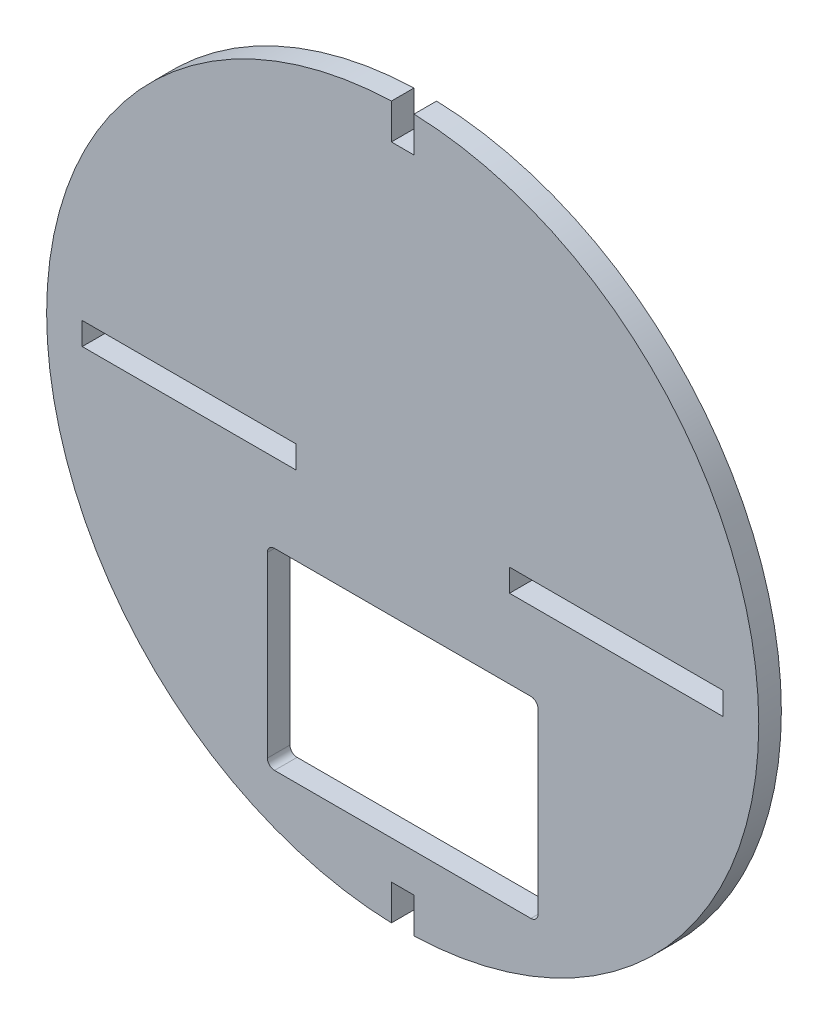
ISO-10303-21;
HEADER;
FILE_DESCRIPTION(('STEP AP214'),'2;1');
FILE_NAME('part.step','',(''),(''),'','','');
FILE_SCHEMA(('AUTOMOTIVE_DESIGN { 1 0 10303 214 1 1 1 1 }'));
ENDSEC;
DATA;
#1=APPLICATION_CONTEXT('core data for automotive mechanical design processes');
#2=APPLICATION_PROTOCOL_DEFINITION('international standard','automotive_design',2000,#1);
#3=PRODUCT_CONTEXT('',#1,'mechanical');
#4=PRODUCT('Part','Part','',(#3));
#5=PRODUCT_RELATED_PRODUCT_CATEGORY('part','',(#4));
#6=PRODUCT_DEFINITION_FORMATION('','',#4);
#7=PRODUCT_DEFINITION_CONTEXT('part definition',#1,'design');
#8=PRODUCT_DEFINITION('design','',#6,#7);
#9=PRODUCT_DEFINITION_SHAPE('','',#8);
#10=(LENGTH_UNIT() NAMED_UNIT(*) SI_UNIT(.MILLI.,.METRE.));
#11=(NAMED_UNIT(*) PLANE_ANGLE_UNIT() SI_UNIT($,.RADIAN.));
#12=(NAMED_UNIT(*) SI_UNIT($,.STERADIAN.) SOLID_ANGLE_UNIT());
#13=UNCERTAINTY_MEASURE_WITH_UNIT(LENGTH_MEASURE(1.E-05),#10,'distance_accuracy_value','');
#14=(GEOMETRIC_REPRESENTATION_CONTEXT(3) GLOBAL_UNCERTAINTY_ASSIGNED_CONTEXT((#13)) GLOBAL_UNIT_ASSIGNED_CONTEXT((#10,
#11,#12)) REPRESENTATION_CONTEXT('',''));
#15=CARTESIAN_POINT('',(0.,0.,0.));
#16=DIRECTION('',(0.,0.,1.));
#17=DIRECTION('',(1.,0.,0.));
#18=AXIS2_PLACEMENT_3D('',#15,#16,#17);
#19=CARTESIAN_POINT('',(0.,0.,3.175));
#20=DIRECTION('',(0.,0.,1.));
#21=DIRECTION('',(1.,0.,0.));
#22=AXIS2_PLACEMENT_3D('',#19,#20,#21);
#23=PLANE('',#22);
#24=CARTESIAN_POINT('',(0.,0.,3.175));
#25=DIRECTION('',(0.,0.,1.));
#26=DIRECTION('',(1.,0.,0.));
#27=AXIS2_PLACEMENT_3D('',#24,#25,#26);
#28=CIRCLE('',#27,50.);
#29=CARTESIAN_POINT('',(1.5875,-49.9747920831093,3.175));
#30=VERTEX_POINT('',#29);
#31=CARTESIAN_POINT('',(1.5875,49.9747920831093,3.175));
#32=VERTEX_POINT('',#31);
#33=EDGE_CURVE('E323',#30,#32,#28,.T.);
#34=ORIENTED_EDGE('',*,*,#33,.T.);
#35=DIRECTION('',(0.,-1.,0.));
#36=VECTOR('',#35,1.);
#37=CARTESIAN_POINT('',(1.5875,49.9747920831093,3.175));
#38=LINE('',#37,#36);
#39=CARTESIAN_POINT('',(1.5875,45.,3.175));
#40=VERTEX_POINT('',#39);
#41=EDGE_CURVE('E326',#32,#40,#38,.T.);
#42=ORIENTED_EDGE('',*,*,#41,.T.);
#43=DIRECTION('',(-1.,0.,0.));
#44=VECTOR('',#43,1.);
#45=CARTESIAN_POINT('',(-1.5875,45.,3.175));
#46=LINE('',#45,#44);
#47=CARTESIAN_POINT('',(-1.5875,45.,3.175));
#48=VERTEX_POINT('',#47);
#49=EDGE_CURVE('E329',#40,#48,#46,.T.);
#50=ORIENTED_EDGE('',*,*,#49,.T.);
#51=DIRECTION('',(0.,1.,0.));
#52=VECTOR('',#51,1.);
#53=CARTESIAN_POINT('',(-1.5875,49.9747920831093,3.175));
#54=LINE('',#53,#52);
#55=CARTESIAN_POINT('',(-1.5875,49.9747920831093,3.175));
#56=VERTEX_POINT('',#55);
#57=EDGE_CURVE('E331',#48,#56,#54,.T.);
#58=ORIENTED_EDGE('',*,*,#57,.T.);
#59=CARTESIAN_POINT('',(0.,0.,3.175));
#60=DIRECTION('',(0.,0.,1.));
#61=DIRECTION('',(1.,0.,0.));
#62=AXIS2_PLACEMENT_3D('',#59,#60,#61);
#63=CIRCLE('',#62,50.);
#64=CARTESIAN_POINT('',(-1.5875,-49.9747920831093,3.175));
#65=VERTEX_POINT('',#64);
#66=EDGE_CURVE('E333',#56,#65,#63,.T.);
#67=ORIENTED_EDGE('',*,*,#66,.T.);
#68=DIRECTION('',(0.,1.,0.));
#69=VECTOR('',#68,1.);
#70=CARTESIAN_POINT('',(-1.5875,-49.9747920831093,3.175));
#71=LINE('',#70,#69);
#72=CARTESIAN_POINT('',(-1.5875,-45.,3.175));
#73=VERTEX_POINT('',#72);
#74=EDGE_CURVE('E335',#65,#73,#71,.T.);
#75=ORIENTED_EDGE('',*,*,#74,.T.);
#76=DIRECTION('',(1.,0.,0.));
#77=VECTOR('',#76,1.);
#78=CARTESIAN_POINT('',(-1.5875,-45.,3.175));
#79=LINE('',#78,#77);
#80=CARTESIAN_POINT('',(1.5875,-45.,3.175));
#81=VERTEX_POINT('',#80);
#82=EDGE_CURVE('E337',#73,#81,#79,.T.);
#83=ORIENTED_EDGE('',*,*,#82,.T.);
#84=DIRECTION('',(0.,-1.,0.));
#85=VECTOR('',#84,1.);
#86=CARTESIAN_POINT('',(1.5875,-49.9747920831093,3.175));
#87=LINE('',#86,#85);
#88=EDGE_CURVE('E339',#81,#30,#87,.T.);
#89=ORIENTED_EDGE('',*,*,#88,.T.);
#90=EDGE_LOOP('',(#34,#42,#50,#58,#67,#75,#83,#89));
#91=FACE_BOUND('',#90,.T.);
#92=DIRECTION('',(-1.,0.,0.));
#93=VECTOR('',#92,1.);
#94=CARTESIAN_POINT('',(-45.,1.58749999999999,3.175));
#95=LINE('',#94,#93);
#96=CARTESIAN_POINT('',(-15.,1.58749999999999,3.175));
#97=VERTEX_POINT('',#96);
#98=CARTESIAN_POINT('',(-45.,1.58749999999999,3.175));
#99=VERTEX_POINT('',#98);
#100=EDGE_CURVE('E294',#97,#99,#95,.T.);
#101=ORIENTED_EDGE('',*,*,#100,.F.);
#102=DIRECTION('',(0.,1.,0.));
#103=VECTOR('',#102,1.);
#104=CARTESIAN_POINT('',(-15.,-1.58750000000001,3.175));
#105=LINE('',#104,#103);
#106=CARTESIAN_POINT('',(-15.,-1.58750000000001,3.175));
#107=VERTEX_POINT('',#106);
#108=EDGE_CURVE('E292',#107,#97,#105,.T.);
#109=ORIENTED_EDGE('',*,*,#108,.F.);
#110=DIRECTION('',(1.,0.,0.));
#111=VECTOR('',#110,1.);
#112=CARTESIAN_POINT('',(-45.,-1.58750000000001,3.175));
#113=LINE('',#112,#111);
#114=CARTESIAN_POINT('',(-45.,-1.58750000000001,3.175));
#115=VERTEX_POINT('',#114);
#116=EDGE_CURVE('E300',#115,#107,#113,.T.);
#117=ORIENTED_EDGE('',*,*,#116,.F.);
#118=DIRECTION('',(0.,-1.,0.));
#119=VECTOR('',#118,1.);
#120=CARTESIAN_POINT('',(-45.,-1.58750000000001,3.175));
#121=LINE('',#120,#119);
#122=EDGE_CURVE('E297',#99,#115,#121,.T.);
#123=ORIENTED_EDGE('',*,*,#122,.F.);
#124=EDGE_LOOP('',(#101,#109,#117,#123));
#125=FACE_BOUND('',#124,.T.);
#126=DIRECTION('',(-1.,0.,0.));
#127=VECTOR('',#126,1.);
#128=CARTESIAN_POINT('',(45.,1.58749999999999,3.175));
#129=LINE('',#128,#127);
#130=CARTESIAN_POINT('',(45.,1.58749999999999,3.175));
#131=VERTEX_POINT('',#130);
#132=CARTESIAN_POINT('',(15.,1.58749999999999,3.175));
#133=VERTEX_POINT('',#132);
#134=EDGE_CURVE('E263',#131,#133,#129,.T.);
#135=ORIENTED_EDGE('',*,*,#134,.F.);
#136=DIRECTION('',(0.,1.,0.));
#137=VECTOR('',#136,1.);
#138=CARTESIAN_POINT('',(45.,-1.58750000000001,3.175));
#139=LINE('',#138,#137);
#140=CARTESIAN_POINT('',(45.,-1.58750000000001,3.175));
#141=VERTEX_POINT('',#140);
#142=EDGE_CURVE('E261',#141,#131,#139,.T.);
#143=ORIENTED_EDGE('',*,*,#142,.F.);
#144=DIRECTION('',(1.,0.,0.));
#145=VECTOR('',#144,1.);
#146=CARTESIAN_POINT('',(45.,-1.58750000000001,3.175));
#147=LINE('',#146,#145);
#148=CARTESIAN_POINT('',(15.,-1.58750000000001,3.175));
#149=VERTEX_POINT('',#148);
#150=EDGE_CURVE('E269',#149,#141,#147,.T.);
#151=ORIENTED_EDGE('',*,*,#150,.F.);
#152=DIRECTION('',(0.,-1.,0.));
#153=VECTOR('',#152,1.);
#154=CARTESIAN_POINT('',(15.,-1.58750000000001,3.175));
#155=LINE('',#154,#153);
#156=EDGE_CURVE('E266',#133,#149,#155,.T.);
#157=ORIENTED_EDGE('',*,*,#156,.F.);
#158=EDGE_LOOP('',(#135,#143,#151,#157));
#159=FACE_BOUND('',#158,.T.);
#160=DIRECTION('',(0.,-1.,0.));
#161=VECTOR('',#160,1.);
#162=CARTESIAN_POINT('',(-19.,-13.6300594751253,3.175));
#163=LINE('',#162,#161);
#164=CARTESIAN_POINT('',(-19.,-13.6300594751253,3.175));
#165=VERTEX_POINT('',#164);
#166=CARTESIAN_POINT('',(-19.,-38.6300594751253,3.175));
#167=VERTEX_POINT('',#166);
#168=EDGE_CURVE('E204',#165,#167,#163,.T.);
#169=ORIENTED_EDGE('',*,*,#168,.F.);
#170=CARTESIAN_POINT('',(-18.,-13.6300594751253,3.175));
#171=DIRECTION('',(0.,0.,1.));
#172=DIRECTION('',(-1.,0.,0.));
#173=AXIS2_PLACEMENT_3D('',#170,#171,#172);
#174=CIRCLE('',#173,1.);
#175=CARTESIAN_POINT('',(-18.,-12.6300594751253,3.175));
#176=VERTEX_POINT('',#175);
#177=EDGE_CURVE('E196',#176,#165,#174,.T.);
#178=ORIENTED_EDGE('',*,*,#177,.F.);
#179=DIRECTION('',(-1.,0.,0.));
#180=VECTOR('',#179,1.);
#181=CARTESIAN_POINT('',(-18.,-12.6300594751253,3.175));
#182=LINE('',#181,#180);
#183=CARTESIAN_POINT('',(18.,-12.6300594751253,3.175));
#184=VERTEX_POINT('',#183);
#185=EDGE_CURVE('E229',#184,#176,#182,.T.);
#186=ORIENTED_EDGE('',*,*,#185,.F.);
#187=CARTESIAN_POINT('',(18.,-13.6300594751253,3.175));
#188=DIRECTION('',(0.,0.,1.));
#189=DIRECTION('',(1.,0.,0.));
#190=AXIS2_PLACEMENT_3D('',#187,#188,#189);
#191=CIRCLE('',#190,0.999999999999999);
#192=CARTESIAN_POINT('',(19.,-13.6300594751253,3.175));
#193=VERTEX_POINT('',#192);
#194=EDGE_CURVE('E227',#193,#184,#191,.T.);
#195=ORIENTED_EDGE('',*,*,#194,.F.);
#196=DIRECTION('',(0.,1.,0.));
#197=VECTOR('',#196,1.);
#198=CARTESIAN_POINT('',(19.,-13.6300594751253,3.175));
#199=LINE('',#198,#197);
#200=CARTESIAN_POINT('',(19.,-38.6300594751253,3.175));
#201=VERTEX_POINT('',#200);
#202=EDGE_CURVE('E225',#201,#193,#199,.T.);
#203=ORIENTED_EDGE('',*,*,#202,.F.);
#204=CARTESIAN_POINT('',(18.,-38.6300594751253,3.175));
#205=DIRECTION('',(0.,0.,1.));
#206=DIRECTION('',(-1.,0.,0.));
#207=AXIS2_PLACEMENT_3D('',#204,#205,#206);
#208=CIRCLE('',#207,0.999999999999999);
#209=CARTESIAN_POINT('',(18.,-39.6300594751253,3.175));
#210=VERTEX_POINT('',#209);
#211=EDGE_CURVE('E223',#210,#201,#208,.T.);
#212=ORIENTED_EDGE('',*,*,#211,.F.);
#213=DIRECTION('',(1.,0.,0.));
#214=VECTOR('',#213,1.);
#215=CARTESIAN_POINT('',(-18.,-39.6300594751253,3.175));
#216=LINE('',#215,#214);
#217=CARTESIAN_POINT('',(-18.,-39.6300594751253,3.175));
#218=VERTEX_POINT('',#217);
#219=EDGE_CURVE('E219',#218,#210,#216,.T.);
#220=ORIENTED_EDGE('',*,*,#219,.F.);
#221=CARTESIAN_POINT('',(-18.,-38.6300594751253,3.175));
#222=DIRECTION('',(0.,0.,1.));
#223=DIRECTION('',(-1.,0.,0.));
#224=AXIS2_PLACEMENT_3D('',#221,#222,#223);
#225=CIRCLE('',#224,1.);
#226=EDGE_CURVE('E217',#167,#218,#225,.T.);
#227=ORIENTED_EDGE('',*,*,#226,.F.);
#228=EDGE_LOOP('',(#169,#178,#186,#195,#203,#212,#220,#227));
#229=FACE_BOUND('',#228,.T.);
#230=ADVANCED_FACE('F35',(#91,#125,#159,#229),#23,.T.);
#231=CARTESIAN_POINT('',(0.,0.,0.));
#232=DIRECTION('',(0.,0.,1.));
#233=DIRECTION('',(1.,0.,0.));
#234=AXIS2_PLACEMENT_3D('',#231,#232,#233);
#235=PLANE('',#234);
#236=DIRECTION('',(0.,1.,0.));
#237=VECTOR('',#236,1.);
#238=CARTESIAN_POINT('',(45.,-1.58750000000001,0.));
#239=LINE('',#238,#237);
#240=CARTESIAN_POINT('',(45.,-1.58750000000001,0.));
#241=VERTEX_POINT('',#240);
#242=CARTESIAN_POINT('',(45.,1.58749999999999,0.));
#243=VERTEX_POINT('',#242);
#244=EDGE_CURVE('E212',#241,#243,#239,.T.);
#245=ORIENTED_EDGE('',*,*,#244,.T.);
#246=DIRECTION('',(-1.,0.,0.));
#247=VECTOR('',#246,1.);
#248=CARTESIAN_POINT('',(45.,1.58749999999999,0.));
#249=LINE('',#248,#247);
#250=CARTESIAN_POINT('',(15.,1.58749999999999,0.));
#251=VERTEX_POINT('',#250);
#252=EDGE_CURVE('E274',#243,#251,#249,.T.);
#253=ORIENTED_EDGE('',*,*,#252,.T.);
#254=DIRECTION('',(0.,-1.,0.));
#255=VECTOR('',#254,1.);
#256=CARTESIAN_POINT('',(15.,-1.58750000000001,0.));
#257=LINE('',#256,#255);
#258=CARTESIAN_POINT('',(15.,-1.58750000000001,0.));
#259=VERTEX_POINT('',#258);
#260=EDGE_CURVE('E277',#251,#259,#257,.T.);
#261=ORIENTED_EDGE('',*,*,#260,.T.);
#262=DIRECTION('',(1.,0.,0.));
#263=VECTOR('',#262,1.);
#264=CARTESIAN_POINT('',(45.,-1.58750000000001,0.));
#265=LINE('',#264,#263);
#266=EDGE_CURVE('E264',#259,#241,#265,.T.);
#267=ORIENTED_EDGE('',*,*,#266,.T.);
#268=EDGE_LOOP('',(#245,#253,#261,#267));
#269=FACE_BOUND('',#268,.T.);
#270=CARTESIAN_POINT('',(0.,0.,0.));
#271=DIRECTION('',(0.,0.,1.));
#272=DIRECTION('',(1.,0.,0.));
#273=AXIS2_PLACEMENT_3D('',#270,#271,#272);
#274=CIRCLE('',#273,50.);
#275=CARTESIAN_POINT('',(1.5875,-49.9747920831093,0.));
#276=VERTEX_POINT('',#275);
#277=CARTESIAN_POINT('',(1.5875,49.9747920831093,0.));
#278=VERTEX_POINT('',#277);
#279=EDGE_CURVE('E322',#276,#278,#274,.T.);
#280=ORIENTED_EDGE('',*,*,#279,.F.);
#281=DIRECTION('',(0.,-1.,0.));
#282=VECTOR('',#281,1.);
#283=CARTESIAN_POINT('',(1.5875,-49.9747920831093,0.));
#284=LINE('',#283,#282);
#285=CARTESIAN_POINT('',(1.5875,-45.,0.));
#286=VERTEX_POINT('',#285);
#287=EDGE_CURVE('E327',#286,#276,#284,.T.);
#288=ORIENTED_EDGE('',*,*,#287,.F.);
#289=DIRECTION('',(1.,0.,0.));
#290=VECTOR('',#289,1.);
#291=CARTESIAN_POINT('',(-1.5875,-45.,0.));
#292=LINE('',#291,#290);
#293=CARTESIAN_POINT('',(-1.5875,-45.,0.));
#294=VERTEX_POINT('',#293);
#295=EDGE_CURVE('E354',#294,#286,#292,.T.);
#296=ORIENTED_EDGE('',*,*,#295,.F.);
#297=DIRECTION('',(0.,1.,0.));
#298=VECTOR('',#297,1.);
#299=CARTESIAN_POINT('',(-1.5875,-49.9747920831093,0.));
#300=LINE('',#299,#298);
#301=CARTESIAN_POINT('',(-1.5875,-49.9747920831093,0.));
#302=VERTEX_POINT('',#301);
#303=EDGE_CURVE('E352',#302,#294,#300,.T.);
#304=ORIENTED_EDGE('',*,*,#303,.F.);
#305=CARTESIAN_POINT('',(0.,0.,0.));
#306=DIRECTION('',(0.,0.,1.));
#307=DIRECTION('',(1.,0.,0.));
#308=AXIS2_PLACEMENT_3D('',#305,#306,#307);
#309=CIRCLE('',#308,50.);
#310=CARTESIAN_POINT('',(-1.5875,49.9747920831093,0.));
#311=VERTEX_POINT('',#310);
#312=EDGE_CURVE('E350',#311,#302,#309,.T.);
#313=ORIENTED_EDGE('',*,*,#312,.F.);
#314=DIRECTION('',(0.,1.,0.));
#315=VECTOR('',#314,1.);
#316=CARTESIAN_POINT('',(-1.5875,49.9747920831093,0.));
#317=LINE('',#316,#315);
#318=CARTESIAN_POINT('',(-1.5875,45.,0.));
#319=VERTEX_POINT('',#318);
#320=EDGE_CURVE('E348',#319,#311,#317,.T.);
#321=ORIENTED_EDGE('',*,*,#320,.F.);
#322=DIRECTION('',(-1.,0.,0.));
#323=VECTOR('',#322,1.);
#324=CARTESIAN_POINT('',(-1.5875,45.,0.));
#325=LINE('',#324,#323);
#326=CARTESIAN_POINT('',(1.5875,45.,0.));
#327=VERTEX_POINT('',#326);
#328=EDGE_CURVE('E346',#327,#319,#325,.T.);
#329=ORIENTED_EDGE('',*,*,#328,.F.);
#330=DIRECTION('',(0.,-1.,0.));
#331=VECTOR('',#330,1.);
#332=CARTESIAN_POINT('',(1.5875,49.9747920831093,0.));
#333=LINE('',#332,#331);
#334=EDGE_CURVE('E344',#278,#327,#333,.T.);
#335=ORIENTED_EDGE('',*,*,#334,.F.);
#336=EDGE_LOOP('',(#280,#288,#296,#304,#313,#321,#329,#335));
#337=FACE_BOUND('',#336,.T.);
#338=DIRECTION('',(0.,1.,0.));
#339=VECTOR('',#338,1.);
#340=CARTESIAN_POINT('',(-15.,-1.58750000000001,0.));
#341=LINE('',#340,#339);
#342=CARTESIAN_POINT('',(-15.,-1.58750000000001,0.));
#343=VERTEX_POINT('',#342);
#344=CARTESIAN_POINT('',(-15.,1.58749999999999,0.));
#345=VERTEX_POINT('',#344);
#346=EDGE_CURVE('E291',#343,#345,#341,.T.);
#347=ORIENTED_EDGE('',*,*,#346,.T.);
#348=DIRECTION('',(-1.,0.,0.));
#349=VECTOR('',#348,1.);
#350=CARTESIAN_POINT('',(-45.,1.58749999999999,0.));
#351=LINE('',#350,#349);
#352=CARTESIAN_POINT('',(-45.,1.58749999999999,0.));
#353=VERTEX_POINT('',#352);
#354=EDGE_CURVE('E305',#345,#353,#351,.T.);
#355=ORIENTED_EDGE('',*,*,#354,.T.);
#356=DIRECTION('',(0.,-1.,0.));
#357=VECTOR('',#356,1.);
#358=CARTESIAN_POINT('',(-45.,-1.58750000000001,0.));
#359=LINE('',#358,#357);
#360=CARTESIAN_POINT('',(-45.,-1.58750000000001,0.));
#361=VERTEX_POINT('',#360);
#362=EDGE_CURVE('E308',#353,#361,#359,.T.);
#363=ORIENTED_EDGE('',*,*,#362,.T.);
#364=DIRECTION('',(1.,0.,0.));
#365=VECTOR('',#364,1.);
#366=CARTESIAN_POINT('',(-45.,-1.58750000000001,0.));
#367=LINE('',#366,#365);
#368=EDGE_CURVE('E295',#361,#343,#367,.T.);
#369=ORIENTED_EDGE('',*,*,#368,.T.);
#370=EDGE_LOOP('',(#347,#355,#363,#369));
#371=FACE_BOUND('',#370,.T.);
#372=CARTESIAN_POINT('',(-18.,-13.6300594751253,0.));
#373=DIRECTION('',(0.,0.,1.));
#374=DIRECTION('',(-1.,0.,0.));
#375=AXIS2_PLACEMENT_3D('',#372,#373,#374);
#376=CIRCLE('',#375,1.);
#377=CARTESIAN_POINT('',(-18.,-12.6300594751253,0.));
#378=VERTEX_POINT('',#377);
#379=CARTESIAN_POINT('',(-19.,-13.6300594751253,0.));
#380=VERTEX_POINT('',#379);
#381=EDGE_CURVE('E58',#378,#380,#376,.T.);
#382=ORIENTED_EDGE('',*,*,#381,.T.);
#383=DIRECTION('',(0.,-1.,0.));
#384=VECTOR('',#383,1.);
#385=CARTESIAN_POINT('',(-19.,-13.6300594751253,0.));
#386=LINE('',#385,#384);
#387=CARTESIAN_POINT('',(-19.,-38.6300594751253,0.));
#388=VERTEX_POINT('',#387);
#389=EDGE_CURVE('E211',#380,#388,#386,.T.);
#390=ORIENTED_EDGE('',*,*,#389,.T.);
#391=CARTESIAN_POINT('',(-18.,-38.6300594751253,0.));
#392=DIRECTION('',(0.,0.,1.));
#393=DIRECTION('',(-1.,0.,0.));
#394=AXIS2_PLACEMENT_3D('',#391,#392,#393);
#395=CIRCLE('',#394,1.);
#396=CARTESIAN_POINT('',(-18.,-39.6300594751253,0.));
#397=VERTEX_POINT('',#396);
#398=EDGE_CURVE('E233',#388,#397,#395,.T.);
#399=ORIENTED_EDGE('',*,*,#398,.T.);
#400=DIRECTION('',(1.,0.,0.));
#401=VECTOR('',#400,1.);
#402=CARTESIAN_POINT('',(-18.,-39.6300594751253,0.));
#403=LINE('',#402,#401);
#404=CARTESIAN_POINT('',(18.,-39.6300594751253,0.));
#405=VERTEX_POINT('',#404);
#406=EDGE_CURVE('E236',#397,#405,#403,.T.);
#407=ORIENTED_EDGE('',*,*,#406,.T.);
#408=CARTESIAN_POINT('',(18.,-38.6300594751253,0.));
#409=DIRECTION('',(0.,0.,1.));
#410=DIRECTION('',(-1.,0.,0.));
#411=AXIS2_PLACEMENT_3D('',#408,#409,#410);
#412=CIRCLE('',#411,0.999999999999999);
#413=CARTESIAN_POINT('',(19.,-38.6300594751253,0.));
#414=VERTEX_POINT('',#413);
#415=EDGE_CURVE('E239',#405,#414,#412,.T.);
#416=ORIENTED_EDGE('',*,*,#415,.T.);
#417=DIRECTION('',(0.,1.,0.));
#418=VECTOR('',#417,1.);
#419=CARTESIAN_POINT('',(19.,-13.6300594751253,0.));
#420=LINE('',#419,#418);
#421=CARTESIAN_POINT('',(19.,-13.6300594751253,0.));
#422=VERTEX_POINT('',#421);
#423=EDGE_CURVE('E242',#414,#422,#420,.T.);
#424=ORIENTED_EDGE('',*,*,#423,.T.);
#425=CARTESIAN_POINT('',(18.,-13.6300594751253,0.));
#426=DIRECTION('',(0.,0.,1.));
#427=DIRECTION('',(1.,0.,0.));
#428=AXIS2_PLACEMENT_3D('',#425,#426,#427);
#429=CIRCLE('',#428,0.999999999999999);
#430=CARTESIAN_POINT('',(18.,-12.6300594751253,0.));
#431=VERTEX_POINT('',#430);
#432=EDGE_CURVE('E245',#422,#431,#429,.T.);
#433=ORIENTED_EDGE('',*,*,#432,.T.);
#434=DIRECTION('',(-1.,0.,0.));
#435=VECTOR('',#434,1.);
#436=CARTESIAN_POINT('',(-18.,-12.6300594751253,0.));
#437=LINE('',#436,#435);
#438=EDGE_CURVE('E205',#431,#378,#437,.T.);
#439=ORIENTED_EDGE('',*,*,#438,.T.);
#440=EDGE_LOOP('',(#382,#390,#399,#407,#416,#424,#433,#439));
#441=FACE_BOUND('',#440,.T.);
#442=ADVANCED_FACE('F384',(#269,#337,#371,#441),#235,.F.);
#443=CARTESIAN_POINT('',(0.,0.,3.175));
#444=DIRECTION('',(0.,0.,-1.));
#445=DIRECTION('',(-1.,0.,0.));
#446=AXIS2_PLACEMENT_3D('',#443,#444,#445);
#447=CYLINDRICAL_SURFACE('',#446,50.);
#448=ORIENTED_EDGE('',*,*,#279,.T.);
#449=DIRECTION('',(0.,0.,-1.));
#450=VECTOR('',#449,1.);
#451=CARTESIAN_POINT('',(1.5875,49.9747920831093,3.175));
#452=LINE('',#451,#450);
#453=EDGE_CURVE('E11',#32,#278,#452,.T.);
#454=ORIENTED_EDGE('',*,*,#453,.F.);
#455=ORIENTED_EDGE('',*,*,#33,.F.);
#456=DIRECTION('',(0.,0.,-1.));
#457=VECTOR('',#456,1.);
#458=CARTESIAN_POINT('',(1.5875,-49.9747920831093,3.175));
#459=LINE('',#458,#457);
#460=EDGE_CURVE('E341',#30,#276,#459,.T.);
#461=ORIENTED_EDGE('',*,*,#460,.T.);
#462=EDGE_LOOP('',(#448,#454,#455,#461));
#463=FACE_BOUND('',#462,.T.);
#464=ADVANCED_FACE('F37',(#463),#447,.T.);
#465=CARTESIAN_POINT('',(1.5875,49.9747920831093,3.175));
#466=DIRECTION('',(1.,0.,0.));
#467=DIRECTION('',(0.,1.,0.));
#468=AXIS2_PLACEMENT_3D('',#465,#466,#467);
#469=PLANE('',#468);
#470=ORIENTED_EDGE('',*,*,#334,.T.);
#471=DIRECTION('',(0.,0.,-1.));
#472=VECTOR('',#471,1.);
#473=CARTESIAN_POINT('',(1.5875,45.,3.175));
#474=LINE('',#473,#472);
#475=EDGE_CURVE('E43',#40,#327,#474,.T.);
#476=ORIENTED_EDGE('',*,*,#475,.F.);
#477=ORIENTED_EDGE('',*,*,#41,.F.);
#478=ORIENTED_EDGE('',*,*,#453,.T.);
#479=EDGE_LOOP('',(#470,#476,#477,#478));
#480=FACE_BOUND('',#479,.T.);
#481=ADVANCED_FACE('F402',(#480),#469,.F.);
#482=CARTESIAN_POINT('',(-1.5875,45.,3.175));
#483=DIRECTION('',(0.,-1.,0.));
#484=DIRECTION('',(0.,0.,-1.));
#485=AXIS2_PLACEMENT_3D('',#482,#483,#484);
#486=PLANE('',#485);
#487=ORIENTED_EDGE('',*,*,#328,.T.);
#488=DIRECTION('',(0.,0.,-1.));
#489=VECTOR('',#488,1.);
#490=CARTESIAN_POINT('',(-1.5875,45.,3.175));
#491=LINE('',#490,#489);
#492=EDGE_CURVE('E371',#48,#319,#491,.T.);
#493=ORIENTED_EDGE('',*,*,#492,.F.);
#494=ORIENTED_EDGE('',*,*,#49,.F.);
#495=ORIENTED_EDGE('',*,*,#475,.T.);
#496=EDGE_LOOP('',(#487,#493,#494,#495));
#497=FACE_BOUND('',#496,.T.);
#498=ADVANCED_FACE('F378',(#497),#486,.F.);
#499=CARTESIAN_POINT('',(-1.5875,49.9747920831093,3.175));
#500=DIRECTION('',(-1.,0.,0.));
#501=DIRECTION('',(0.,-1.,0.));
#502=AXIS2_PLACEMENT_3D('',#499,#500,#501);
#503=PLANE('',#502);
#504=ORIENTED_EDGE('',*,*,#320,.T.);
#505=DIRECTION('',(0.,0.,-1.));
#506=VECTOR('',#505,1.);
#507=CARTESIAN_POINT('',(-1.5875,49.9747920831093,3.175));
#508=LINE('',#507,#506);
#509=EDGE_CURVE('E368',#56,#311,#508,.T.);
#510=ORIENTED_EDGE('',*,*,#509,.F.);
#511=ORIENTED_EDGE('',*,*,#57,.F.);
#512=ORIENTED_EDGE('',*,*,#492,.T.);
#513=EDGE_LOOP('',(#504,#510,#511,#512));
#514=FACE_BOUND('',#513,.T.);
#515=ADVANCED_FACE('F390',(#514),#503,.F.);
#516=CARTESIAN_POINT('',(0.,0.,3.175));
#517=DIRECTION('',(0.,0.,-1.));
#518=DIRECTION('',(-1.,0.,0.));
#519=AXIS2_PLACEMENT_3D('',#516,#517,#518);
#520=CYLINDRICAL_SURFACE('',#519,50.);
#521=ORIENTED_EDGE('',*,*,#312,.T.);
#522=DIRECTION('',(0.,0.,-1.));
#523=VECTOR('',#522,1.);
#524=CARTESIAN_POINT('',(-1.5875,-49.9747920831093,3.175));
#525=LINE('',#524,#523);
#526=EDGE_CURVE('E365',#65,#302,#525,.T.);
#527=ORIENTED_EDGE('',*,*,#526,.F.);
#528=ORIENTED_EDGE('',*,*,#66,.F.);
#529=ORIENTED_EDGE('',*,*,#509,.T.);
#530=EDGE_LOOP('',(#521,#527,#528,#529));
#531=FACE_BOUND('',#530,.T.);
#532=ADVANCED_FACE('F394',(#531),#520,.T.);
#533=CARTESIAN_POINT('',(-1.5875,-49.9747920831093,3.175));
#534=DIRECTION('',(-1.,0.,0.));
#535=DIRECTION('',(0.,0.,1.));
#536=AXIS2_PLACEMENT_3D('',#533,#534,#535);
#537=PLANE('',#536);
#538=ORIENTED_EDGE('',*,*,#303,.T.);
#539=DIRECTION('',(0.,0.,-1.));
#540=VECTOR('',#539,1.);
#541=CARTESIAN_POINT('',(-1.5875,-45.,3.175));
#542=LINE('',#541,#540);
#543=EDGE_CURVE('E362',#73,#294,#542,.T.);
#544=ORIENTED_EDGE('',*,*,#543,.F.);
#545=ORIENTED_EDGE('',*,*,#74,.F.);
#546=ORIENTED_EDGE('',*,*,#526,.T.);
#547=EDGE_LOOP('',(#538,#544,#545,#546));
#548=FACE_BOUND('',#547,.T.);
#549=ADVANCED_FACE('F415',(#548),#537,.F.);
#550=CARTESIAN_POINT('',(-1.5875,-45.,3.175));
#551=DIRECTION('',(0.,1.,0.));
#552=DIRECTION('',(0.,0.,1.));
#553=AXIS2_PLACEMENT_3D('',#550,#551,#552);
#554=PLANE('',#553);
#555=ORIENTED_EDGE('',*,*,#295,.T.);
#556=DIRECTION('',(0.,0.,-1.));
#557=VECTOR('',#556,1.);
#558=CARTESIAN_POINT('',(1.5875,-45.,3.175));
#559=LINE('',#558,#557);
#560=EDGE_CURVE('E359',#81,#286,#559,.T.);
#561=ORIENTED_EDGE('',*,*,#560,.F.);
#562=ORIENTED_EDGE('',*,*,#82,.F.);
#563=ORIENTED_EDGE('',*,*,#543,.T.);
#564=EDGE_LOOP('',(#555,#561,#562,#563));
#565=FACE_BOUND('',#564,.T.);
#566=ADVANCED_FACE('F413',(#565),#554,.F.);
#567=CARTESIAN_POINT('',(1.5875,-49.9747920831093,3.175));
#568=DIRECTION('',(1.,0.,0.));
#569=DIRECTION('',(0.,0.,-1.));
#570=AXIS2_PLACEMENT_3D('',#567,#568,#569);
#571=PLANE('',#570);
#572=ORIENTED_EDGE('',*,*,#287,.T.);
#573=ORIENTED_EDGE('',*,*,#460,.F.);
#574=ORIENTED_EDGE('',*,*,#88,.F.);
#575=ORIENTED_EDGE('',*,*,#560,.T.);
#576=EDGE_LOOP('',(#572,#573,#574,#575));
#577=FACE_BOUND('',#576,.T.);
#578=ADVANCED_FACE('F408',(#577),#571,.F.);
#579=CARTESIAN_POINT('',(-15.,-1.58750000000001,3.175));
#580=DIRECTION('',(-1.,0.,0.));
#581=DIRECTION('',(0.,0.,1.));
#582=AXIS2_PLACEMENT_3D('',#579,#580,#581);
#583=PLANE('',#582);
#584=ORIENTED_EDGE('',*,*,#346,.F.);
#585=DIRECTION('',(0.,0.,-1.));
#586=VECTOR('',#585,1.);
#587=CARTESIAN_POINT('',(-15.,-1.58750000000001,3.175));
#588=LINE('',#587,#586);
#589=EDGE_CURVE('E302',#107,#343,#588,.T.);
#590=ORIENTED_EDGE('',*,*,#589,.F.);
#591=ORIENTED_EDGE('',*,*,#108,.T.);
#592=DIRECTION('',(0.,0.,-1.));
#593=VECTOR('',#592,1.);
#594=CARTESIAN_POINT('',(-15.,1.58749999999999,3.175));
#595=LINE('',#594,#593);
#596=EDGE_CURVE('E319',#97,#345,#595,.T.);
#597=ORIENTED_EDGE('',*,*,#596,.T.);
#598=EDGE_LOOP('',(#584,#590,#591,#597));
#599=FACE_BOUND('',#598,.T.);
#600=ADVANCED_FACE('F432',(#599),#583,.T.);
#601=CARTESIAN_POINT('',(-45.,1.58749999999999,3.175));
#602=DIRECTION('',(0.,-1.,0.));
#603=DIRECTION('',(1.,0.,0.));
#604=AXIS2_PLACEMENT_3D('',#601,#602,#603);
#605=PLANE('',#604);
#606=ORIENTED_EDGE('',*,*,#354,.F.);
#607=ORIENTED_EDGE('',*,*,#596,.F.);
#608=ORIENTED_EDGE('',*,*,#100,.T.);
#609=DIRECTION('',(0.,0.,-1.));
#610=VECTOR('',#609,1.);
#611=CARTESIAN_POINT('',(-45.,1.58749999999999,3.175));
#612=LINE('',#611,#610);
#613=EDGE_CURVE('E317',#99,#353,#612,.T.);
#614=ORIENTED_EDGE('',*,*,#613,.T.);
#615=EDGE_LOOP('',(#606,#607,#608,#614));
#616=FACE_BOUND('',#615,.T.);
#617=ADVANCED_FACE('F439',(#616),#605,.T.);
#618=CARTESIAN_POINT('',(-45.,-1.58750000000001,3.175));
#619=DIRECTION('',(1.,0.,0.));
#620=DIRECTION('',(0.,0.,-1.));
#621=AXIS2_PLACEMENT_3D('',#618,#619,#620);
#622=PLANE('',#621);
#623=ORIENTED_EDGE('',*,*,#362,.F.);
#624=ORIENTED_EDGE('',*,*,#613,.F.);
#625=ORIENTED_EDGE('',*,*,#122,.T.);
#626=DIRECTION('',(0.,0.,-1.));
#627=VECTOR('',#626,1.);
#628=CARTESIAN_POINT('',(-45.,-1.58750000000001,3.175));
#629=LINE('',#628,#627);
#630=EDGE_CURVE('E315',#115,#361,#629,.T.);
#631=ORIENTED_EDGE('',*,*,#630,.T.);
#632=EDGE_LOOP('',(#623,#624,#625,#631));
#633=FACE_BOUND('',#632,.T.);
#634=ADVANCED_FACE('F444',(#633),#622,.T.);
#635=CARTESIAN_POINT('',(-45.,-1.58750000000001,3.175));
#636=DIRECTION('',(0.,1.,0.));
#637=DIRECTION('',(0.,0.,1.));
#638=AXIS2_PLACEMENT_3D('',#635,#636,#637);
#639=PLANE('',#638);
#640=ORIENTED_EDGE('',*,*,#368,.F.);
#641=ORIENTED_EDGE('',*,*,#630,.F.);
#642=ORIENTED_EDGE('',*,*,#116,.T.);
#643=ORIENTED_EDGE('',*,*,#589,.T.);
#644=EDGE_LOOP('',(#640,#641,#642,#643));
#645=FACE_BOUND('',#644,.T.);
#646=ADVANCED_FACE('F451',(#645),#639,.T.);
#647=CARTESIAN_POINT('',(45.,-1.58750000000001,3.175));
#648=DIRECTION('',(-1.,0.,0.));
#649=DIRECTION('',(0.,0.,1.));
#650=AXIS2_PLACEMENT_3D('',#647,#648,#649);
#651=PLANE('',#650);
#652=ORIENTED_EDGE('',*,*,#244,.F.);
#653=DIRECTION('',(0.,0.,-1.));
#654=VECTOR('',#653,1.);
#655=CARTESIAN_POINT('',(45.,-1.58750000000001,3.175));
#656=LINE('',#655,#654);
#657=EDGE_CURVE('E271',#141,#241,#656,.T.);
#658=ORIENTED_EDGE('',*,*,#657,.F.);
#659=ORIENTED_EDGE('',*,*,#142,.T.);
#660=DIRECTION('',(0.,0.,-1.));
#661=VECTOR('',#660,1.);
#662=CARTESIAN_POINT('',(45.,1.58749999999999,3.175));
#663=LINE('',#662,#661);
#664=EDGE_CURVE('E288',#131,#243,#663,.T.);
#665=ORIENTED_EDGE('',*,*,#664,.T.);
#666=EDGE_LOOP('',(#652,#658,#659,#665));
#667=FACE_BOUND('',#666,.T.);
#668=ADVANCED_FACE('F473',(#667),#651,.T.);
#669=CARTESIAN_POINT('',(45.,1.58749999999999,3.175));
#670=DIRECTION('',(0.,-1.,0.));
#671=DIRECTION('',(1.,0.,0.));
#672=AXIS2_PLACEMENT_3D('',#669,#670,#671);
#673=PLANE('',#672);
#674=ORIENTED_EDGE('',*,*,#252,.F.);
#675=ORIENTED_EDGE('',*,*,#664,.F.);
#676=ORIENTED_EDGE('',*,*,#134,.T.);
#677=DIRECTION('',(0.,0.,-1.));
#678=VECTOR('',#677,1.);
#679=CARTESIAN_POINT('',(15.,1.58749999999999,3.175));
#680=LINE('',#679,#678);
#681=EDGE_CURVE('E286',#133,#251,#680,.T.);
#682=ORIENTED_EDGE('',*,*,#681,.T.);
#683=EDGE_LOOP('',(#674,#675,#676,#682));
#684=FACE_BOUND('',#683,.T.);
#685=ADVANCED_FACE('F467',(#684),#673,.T.);
#686=CARTESIAN_POINT('',(15.,-1.58750000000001,3.175));
#687=DIRECTION('',(1.,0.,0.));
#688=DIRECTION('',(0.,0.,-1.));
#689=AXIS2_PLACEMENT_3D('',#686,#687,#688);
#690=PLANE('',#689);
#691=ORIENTED_EDGE('',*,*,#260,.F.);
#692=ORIENTED_EDGE('',*,*,#681,.F.);
#693=ORIENTED_EDGE('',*,*,#156,.T.);
#694=DIRECTION('',(0.,0.,-1.));
#695=VECTOR('',#694,1.);
#696=CARTESIAN_POINT('',(15.,-1.58750000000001,3.175));
#697=LINE('',#696,#695);
#698=EDGE_CURVE('E284',#149,#259,#697,.T.);
#699=ORIENTED_EDGE('',*,*,#698,.T.);
#700=EDGE_LOOP('',(#691,#692,#693,#699));
#701=FACE_BOUND('',#700,.T.);
#702=ADVANCED_FACE('F470',(#701),#690,.T.);
#703=CARTESIAN_POINT('',(45.,-1.58750000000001,3.175));
#704=DIRECTION('',(0.,1.,0.));
#705=DIRECTION('',(0.,0.,1.));
#706=AXIS2_PLACEMENT_3D('',#703,#704,#705);
#707=PLANE('',#706);
#708=ORIENTED_EDGE('',*,*,#266,.F.);
#709=ORIENTED_EDGE('',*,*,#698,.F.);
#710=ORIENTED_EDGE('',*,*,#150,.T.);
#711=ORIENTED_EDGE('',*,*,#657,.T.);
#712=EDGE_LOOP('',(#708,#709,#710,#711));
#713=FACE_BOUND('',#712,.T.);
#714=ADVANCED_FACE('F476',(#713),#707,.T.);
#715=CARTESIAN_POINT('',(-18.,-13.6300594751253,3.175));
#716=DIRECTION('',(0.,0.,-1.));
#717=DIRECTION('',(-1.,0.,0.));
#718=AXIS2_PLACEMENT_3D('',#715,#716,#717);
#719=CYLINDRICAL_SURFACE('',#718,1.);
#720=ORIENTED_EDGE('',*,*,#381,.F.);
#721=DIRECTION('',(0.,0.,-1.));
#722=VECTOR('',#721,1.);
#723=CARTESIAN_POINT('',(-18.,-12.6300594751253,3.175));
#724=LINE('',#723,#722);
#725=EDGE_CURVE('E200',#176,#378,#724,.T.);
#726=ORIENTED_EDGE('',*,*,#725,.F.);
#727=ORIENTED_EDGE('',*,*,#177,.T.);
#728=DIRECTION('',(0.,0.,-1.));
#729=VECTOR('',#728,1.);
#730=CARTESIAN_POINT('',(-19.,-13.6300594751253,3.175));
#731=LINE('',#730,#729);
#732=EDGE_CURVE('E199',#165,#380,#731,.T.);
#733=ORIENTED_EDGE('',*,*,#732,.T.);
#734=EDGE_LOOP('',(#720,#726,#727,#733));
#735=FACE_BOUND('',#734,.T.);
#736=ADVANCED_FACE('F198',(#735),#719,.F.);
#737=CARTESIAN_POINT('',(-19.,-13.6300594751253,3.175));
#738=DIRECTION('',(1.,0.,0.));
#739=DIRECTION('',(0.,1.,0.));
#740=AXIS2_PLACEMENT_3D('',#737,#738,#739);
#741=PLANE('',#740);
#742=ORIENTED_EDGE('',*,*,#389,.F.);
#743=ORIENTED_EDGE('',*,*,#732,.F.);
#744=ORIENTED_EDGE('',*,*,#168,.T.);
#745=DIRECTION('',(0.,0.,-1.));
#746=VECTOR('',#745,1.);
#747=CARTESIAN_POINT('',(-19.,-38.6300594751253,3.175));
#748=LINE('',#747,#746);
#749=EDGE_CURVE('E213',#167,#388,#748,.T.);
#750=ORIENTED_EDGE('',*,*,#749,.T.);
#751=EDGE_LOOP('',(#742,#743,#744,#750));
#752=FACE_BOUND('',#751,.T.);
#753=ADVANCED_FACE('F208',(#752),#741,.T.);
#754=CARTESIAN_POINT('',(-18.,-38.6300594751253,3.175));
#755=DIRECTION('',(0.,0.,-1.));
#756=DIRECTION('',(-1.,0.,0.));
#757=AXIS2_PLACEMENT_3D('',#754,#755,#756);
#758=CYLINDRICAL_SURFACE('',#757,1.);
#759=ORIENTED_EDGE('',*,*,#398,.F.);
#760=ORIENTED_EDGE('',*,*,#749,.F.);
#761=ORIENTED_EDGE('',*,*,#226,.T.);
#762=DIRECTION('',(0.,0.,-1.));
#763=VECTOR('',#762,1.);
#764=CARTESIAN_POINT('',(-18.,-39.6300594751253,3.175));
#765=LINE('',#764,#763);
#766=EDGE_CURVE('E258',#218,#397,#765,.T.);
#767=ORIENTED_EDGE('',*,*,#766,.T.);
#768=EDGE_LOOP('',(#759,#760,#761,#767));
#769=FACE_BOUND('',#768,.T.);
#770=ADVANCED_FACE('F533',(#769),#758,.F.);
#771=CARTESIAN_POINT('',(-18.,-39.6300594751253,3.175));
#772=DIRECTION('',(0.,1.,0.));
#773=DIRECTION('',(-1.,0.,0.));
#774=AXIS2_PLACEMENT_3D('',#771,#772,#773);
#775=PLANE('',#774);
#776=ORIENTED_EDGE('',*,*,#406,.F.);
#777=ORIENTED_EDGE('',*,*,#766,.F.);
#778=ORIENTED_EDGE('',*,*,#219,.T.);
#779=DIRECTION('',(0.,0.,-1.));
#780=VECTOR('',#779,1.);
#781=CARTESIAN_POINT('',(18.,-39.6300594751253,3.175));
#782=LINE('',#781,#780);
#783=EDGE_CURVE('E256',#210,#405,#782,.T.);
#784=ORIENTED_EDGE('',*,*,#783,.T.);
#785=EDGE_LOOP('',(#776,#777,#778,#784));
#786=FACE_BOUND('',#785,.T.);
#787=ADVANCED_FACE('F541',(#786),#775,.T.);
#788=CARTESIAN_POINT('',(18.,-38.6300594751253,3.175));
#789=DIRECTION('',(0.,0.,-1.));
#790=DIRECTION('',(-1.,0.,0.));
#791=AXIS2_PLACEMENT_3D('',#788,#789,#790);
#792=CYLINDRICAL_SURFACE('',#791,0.999999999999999);
#793=ORIENTED_EDGE('',*,*,#415,.F.);
#794=ORIENTED_EDGE('',*,*,#783,.F.);
#795=ORIENTED_EDGE('',*,*,#211,.T.);
#796=DIRECTION('',(0.,0.,-1.));
#797=VECTOR('',#796,1.);
#798=CARTESIAN_POINT('',(19.,-38.6300594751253,3.175));
#799=LINE('',#798,#797);
#800=EDGE_CURVE('E254',#201,#414,#799,.T.);
#801=ORIENTED_EDGE('',*,*,#800,.T.);
#802=EDGE_LOOP('',(#793,#794,#795,#801));
#803=FACE_BOUND('',#802,.T.);
#804=ADVANCED_FACE('F551',(#803),#792,.F.);
#805=CARTESIAN_POINT('',(19.,-13.6300594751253,3.175));
#806=DIRECTION('',(-1.,0.,0.));
#807=DIRECTION('',(0.,-1.,0.));
#808=AXIS2_PLACEMENT_3D('',#805,#806,#807);
#809=PLANE('',#808);
#810=ORIENTED_EDGE('',*,*,#423,.F.);
#811=ORIENTED_EDGE('',*,*,#800,.F.);
#812=ORIENTED_EDGE('',*,*,#202,.T.);
#813=DIRECTION('',(0.,0.,-1.));
#814=VECTOR('',#813,1.);
#815=CARTESIAN_POINT('',(19.,-13.6300594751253,3.175));
#816=LINE('',#815,#814);
#817=EDGE_CURVE('E252',#193,#422,#816,.T.);
#818=ORIENTED_EDGE('',*,*,#817,.T.);
#819=EDGE_LOOP('',(#810,#811,#812,#818));
#820=FACE_BOUND('',#819,.T.);
#821=ADVANCED_FACE('F561',(#820),#809,.T.);
#822=CARTESIAN_POINT('',(18.,-13.6300594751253,3.175));
#823=DIRECTION('',(0.,0.,-1.));
#824=DIRECTION('',(-1.,0.,0.));
#825=AXIS2_PLACEMENT_3D('',#822,#823,#824);
#826=CYLINDRICAL_SURFACE('',#825,0.999999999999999);
#827=ORIENTED_EDGE('',*,*,#432,.F.);
#828=ORIENTED_EDGE('',*,*,#817,.F.);
#829=ORIENTED_EDGE('',*,*,#194,.T.);
#830=DIRECTION('',(0.,0.,-1.));
#831=VECTOR('',#830,1.);
#832=CARTESIAN_POINT('',(18.,-12.6300594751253,3.175));
#833=LINE('',#832,#831);
#834=EDGE_CURVE('E50',#184,#431,#833,.T.);
#835=ORIENTED_EDGE('',*,*,#834,.T.);
#836=EDGE_LOOP('',(#827,#828,#829,#835));
#837=FACE_BOUND('',#836,.T.);
#838=ADVANCED_FACE('F571',(#837),#826,.F.);
#839=CARTESIAN_POINT('',(-18.,-12.6300594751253,3.175));
#840=DIRECTION('',(0.,-1.,0.));
#841=DIRECTION('',(0.,0.,-1.));
#842=AXIS2_PLACEMENT_3D('',#839,#840,#841);
#843=PLANE('',#842);
#844=ORIENTED_EDGE('',*,*,#438,.F.);
#845=ORIENTED_EDGE('',*,*,#834,.F.);
#846=ORIENTED_EDGE('',*,*,#185,.T.);
#847=ORIENTED_EDGE('',*,*,#725,.T.);
#848=EDGE_LOOP('',(#844,#845,#846,#847));
#849=FACE_BOUND('',#848,.T.);
#850=ADVANCED_FACE('F581',(#849),#843,.T.);
#851=CLOSED_SHELL('',(#230,#442,#464,#481,#498,#515,#532,#549,#566,#578,#600,#617,#634,#646,
#668,#685,#702,#714,#736,#753,#770,#787,#804,#821,#838,#850));
#852=MANIFOLD_SOLID_BREP('B2',#851);
#853=ADVANCED_BREP_SHAPE_REPRESENTATION('',(#18,#852),#14);
#854=SHAPE_DEFINITION_REPRESENTATION(#9,#853);
ENDSEC;
END-ISO-10303-21;
